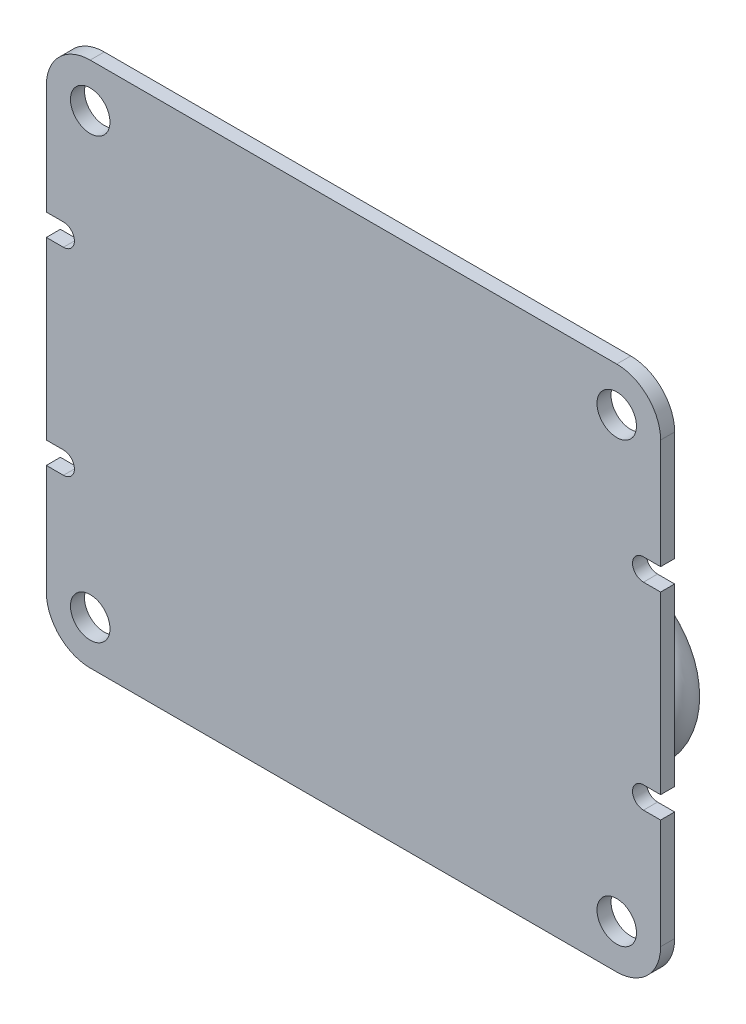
ISO-10303-21;
HEADER;
FILE_DESCRIPTION(('STEP AP214'),'2;1');
FILE_NAME('part.step','',(''),(''),'','','');
FILE_SCHEMA(('AUTOMOTIVE_DESIGN { 1 0 10303 214 1 1 1 1 }'));
ENDSEC;
DATA;
#1=APPLICATION_CONTEXT('core data for automotive mechanical design processes');
#2=APPLICATION_PROTOCOL_DEFINITION('international standard','automotive_design',2000,#1);
#3=PRODUCT_CONTEXT('',#1,'mechanical');
#4=PRODUCT('Part','Part','',(#3));
#5=PRODUCT_RELATED_PRODUCT_CATEGORY('part','',(#4));
#6=PRODUCT_DEFINITION_FORMATION('','',#4);
#7=PRODUCT_DEFINITION_CONTEXT('part definition',#1,'design');
#8=PRODUCT_DEFINITION('design','',#6,#7);
#9=PRODUCT_DEFINITION_SHAPE('','',#8);
#10=(LENGTH_UNIT() NAMED_UNIT(*) SI_UNIT(.MILLI.,.METRE.));
#11=(NAMED_UNIT(*) PLANE_ANGLE_UNIT() SI_UNIT($,.RADIAN.));
#12=(NAMED_UNIT(*) SI_UNIT($,.STERADIAN.) SOLID_ANGLE_UNIT());
#13=UNCERTAINTY_MEASURE_WITH_UNIT(LENGTH_MEASURE(1.E-05),#10,'distance_accuracy_value','');
#14=(GEOMETRIC_REPRESENTATION_CONTEXT(3) GLOBAL_UNCERTAINTY_ASSIGNED_CONTEXT((#13)) GLOBAL_UNIT_ASSIGNED_CONTEXT((#10,
#11,#12)) REPRESENTATION_CONTEXT('',''));
#15=CARTESIAN_POINT('',(0.,0.,0.));
#16=DIRECTION('',(0.,0.,1.));
#17=DIRECTION('',(1.,0.,0.));
#18=AXIS2_PLACEMENT_3D('',#15,#16,#17);
#19=CARTESIAN_POINT('',(30.,25.,0.));
#20=DIRECTION('',(0.,0.,1.));
#21=DIRECTION('',(1.,0.,0.));
#22=AXIS2_PLACEMENT_3D('',#19,#20,#21);
#23=PLANE('',#22);
#24=CARTESIAN_POINT('',(30.,25.,0.));
#25=DIRECTION('',(0.,0.,1.));
#26=DIRECTION('',(1.,0.,0.));
#27=AXIS2_PLACEMENT_3D('',#24,#25,#26);
#28=CIRCLE('',#27,2.24999999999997);
#29=CARTESIAN_POINT('',(32.25,25.,0.));
#30=VERTEX_POINT('',#29);
#31=EDGE_CURVE('E686',#30,#30,#28,.T.);
#32=ORIENTED_EDGE('',*,*,#31,.T.);
#33=EDGE_LOOP('',(#32));
#34=FACE_BOUND('',#33,.T.);
#35=CARTESIAN_POINT('',(-30.,25.,0.));
#36=DIRECTION('',(0.,0.,1.));
#37=DIRECTION('',(1.,0.,0.));
#38=AXIS2_PLACEMENT_3D('',#35,#36,#37);
#39=CIRCLE('',#38,2.24999999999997);
#40=CARTESIAN_POINT('',(-27.75,25.,0.));
#41=VERTEX_POINT('',#40);
#42=EDGE_CURVE('E697',#41,#41,#39,.T.);
#43=ORIENTED_EDGE('',*,*,#42,.T.);
#44=EDGE_LOOP('',(#43));
#45=FACE_BOUND('',#44,.T.);
#46=CARTESIAN_POINT('',(30.,25.,0.));
#47=DIRECTION('',(0.,0.,1.));
#48=DIRECTION('',(1.,0.,0.));
#49=AXIS2_PLACEMENT_3D('',#46,#47,#48);
#50=CIRCLE('',#49,5.);
#51=CARTESIAN_POINT('',(35.,25.,0.));
#52=VERTEX_POINT('',#51);
#53=CARTESIAN_POINT('',(30.,30.,0.));
#54=VERTEX_POINT('',#53);
#55=EDGE_CURVE('E180',#52,#54,#50,.T.);
#56=ORIENTED_EDGE('',*,*,#55,.F.);
#57=DIRECTION('',(0.,1.,0.));
#58=VECTOR('',#57,1.);
#59=CARTESIAN_POINT('',(35.,12.5,0.));
#60=LINE('',#59,#58);
#61=CARTESIAN_POINT('',(35.,12.5,0.));
#62=VERTEX_POINT('',#61);
#63=EDGE_CURVE('E243',#62,#52,#60,.T.);
#64=ORIENTED_EDGE('',*,*,#63,.F.);
#65=DIRECTION('',(1.,0.,0.));
#66=VECTOR('',#65,1.);
#67=CARTESIAN_POINT('',(33.05,12.5,0.));
#68=LINE('',#67,#66);
#69=CARTESIAN_POINT('',(33.05,12.5,0.));
#70=VERTEX_POINT('',#69);
#71=EDGE_CURVE('E241',#70,#62,#68,.T.);
#72=ORIENTED_EDGE('',*,*,#71,.F.);
#73=CARTESIAN_POINT('',(33.05,11.25,0.));
#74=DIRECTION('',(0.,0.,-1.));
#75=DIRECTION('',(1.,0.,0.));
#76=AXIS2_PLACEMENT_3D('',#73,#74,#75);
#77=CIRCLE('',#76,1.25);
#78=CARTESIAN_POINT('',(33.05,10.,0.));
#79=VERTEX_POINT('',#78);
#80=EDGE_CURVE('E239',#79,#70,#77,.T.);
#81=ORIENTED_EDGE('',*,*,#80,.F.);
#82=DIRECTION('',(-1.,0.,0.));
#83=VECTOR('',#82,1.);
#84=CARTESIAN_POINT('',(33.05,10.,0.));
#85=LINE('',#84,#83);
#86=CARTESIAN_POINT('',(35.,10.,0.));
#87=VERTEX_POINT('',#86);
#88=EDGE_CURVE('E237',#87,#79,#85,.T.);
#89=ORIENTED_EDGE('',*,*,#88,.F.);
#90=DIRECTION('',(0.,1.,0.));
#91=VECTOR('',#90,1.);
#92=CARTESIAN_POINT('',(35.,10.,0.));
#93=LINE('',#92,#91);
#94=CARTESIAN_POINT('',(35.,-10.,0.));
#95=VERTEX_POINT('',#94);
#96=EDGE_CURVE('E235',#95,#87,#93,.T.);
#97=ORIENTED_EDGE('',*,*,#96,.F.);
#98=DIRECTION('',(1.,0.,0.));
#99=VECTOR('',#98,1.);
#100=CARTESIAN_POINT('',(33.05,-10.,0.));
#101=LINE('',#100,#99);
#102=CARTESIAN_POINT('',(33.05,-10.,0.));
#103=VERTEX_POINT('',#102);
#104=EDGE_CURVE('E233',#103,#95,#101,.T.);
#105=ORIENTED_EDGE('',*,*,#104,.F.);
#106=CARTESIAN_POINT('',(33.05,-11.25,0.));
#107=DIRECTION('',(0.,0.,-1.));
#108=DIRECTION('',(1.,0.,0.));
#109=AXIS2_PLACEMENT_3D('',#106,#107,#108);
#110=CIRCLE('',#109,1.25);
#111=CARTESIAN_POINT('',(33.05,-12.5,0.));
#112=VERTEX_POINT('',#111);
#113=EDGE_CURVE('E231',#112,#103,#110,.T.);
#114=ORIENTED_EDGE('',*,*,#113,.F.);
#115=DIRECTION('',(-1.,0.,0.));
#116=VECTOR('',#115,1.);
#117=CARTESIAN_POINT('',(33.05,-12.5,0.));
#118=LINE('',#117,#116);
#119=CARTESIAN_POINT('',(35.,-12.5,0.));
#120=VERTEX_POINT('',#119);
#121=EDGE_CURVE('E229',#120,#112,#118,.T.);
#122=ORIENTED_EDGE('',*,*,#121,.F.);
#123=DIRECTION('',(0.,1.,0.));
#124=VECTOR('',#123,1.);
#125=CARTESIAN_POINT('',(35.,-12.5,0.));
#126=LINE('',#125,#124);
#127=CARTESIAN_POINT('',(35.,-25.,0.));
#128=VERTEX_POINT('',#127);
#129=EDGE_CURVE('E227',#128,#120,#126,.T.);
#130=ORIENTED_EDGE('',*,*,#129,.F.);
#131=CARTESIAN_POINT('',(30.,-25.,0.));
#132=DIRECTION('',(0.,0.,1.));
#133=DIRECTION('',(1.,0.,0.));
#134=AXIS2_PLACEMENT_3D('',#131,#132,#133);
#135=CIRCLE('',#134,5.);
#136=CARTESIAN_POINT('',(30.,-30.,0.));
#137=VERTEX_POINT('',#136);
#138=EDGE_CURVE('E225',#137,#128,#135,.T.);
#139=ORIENTED_EDGE('',*,*,#138,.F.);
#140=DIRECTION('',(1.,0.,0.));
#141=VECTOR('',#140,1.);
#142=CARTESIAN_POINT('',(30.,-30.,0.));
#143=LINE('',#142,#141);
#144=CARTESIAN_POINT('',(-30.,-30.,0.));
#145=VERTEX_POINT('',#144);
#146=EDGE_CURVE('E223',#145,#137,#143,.T.);
#147=ORIENTED_EDGE('',*,*,#146,.F.);
#148=CARTESIAN_POINT('',(-30.,-25.,0.));
#149=DIRECTION('',(0.,0.,1.));
#150=DIRECTION('',(1.,0.,0.));
#151=AXIS2_PLACEMENT_3D('',#148,#149,#150);
#152=CIRCLE('',#151,5.);
#153=CARTESIAN_POINT('',(-35.,-25.,0.));
#154=VERTEX_POINT('',#153);
#155=EDGE_CURVE('E221',#154,#145,#152,.T.);
#156=ORIENTED_EDGE('',*,*,#155,.F.);
#157=DIRECTION('',(0.,-1.,0.));
#158=VECTOR('',#157,1.);
#159=CARTESIAN_POINT('',(-35.,-12.5,0.));
#160=LINE('',#159,#158);
#161=CARTESIAN_POINT('',(-35.,-12.5,0.));
#162=VERTEX_POINT('',#161);
#163=EDGE_CURVE('E219',#162,#154,#160,.T.);
#164=ORIENTED_EDGE('',*,*,#163,.F.);
#165=DIRECTION('',(-1.,0.,0.));
#166=VECTOR('',#165,1.);
#167=CARTESIAN_POINT('',(-33.05,-12.5,0.));
#168=LINE('',#167,#166);
#169=CARTESIAN_POINT('',(-33.05,-12.5,0.));
#170=VERTEX_POINT('',#169);
#171=EDGE_CURVE('E217',#170,#162,#168,.T.);
#172=ORIENTED_EDGE('',*,*,#171,.F.);
#173=CARTESIAN_POINT('',(-33.05,-11.25,0.));
#174=DIRECTION('',(0.,0.,-1.));
#175=DIRECTION('',(1.,0.,0.));
#176=AXIS2_PLACEMENT_3D('',#173,#174,#175);
#177=CIRCLE('',#176,1.25);
#178=CARTESIAN_POINT('',(-33.05,-10.,0.));
#179=VERTEX_POINT('',#178);
#180=EDGE_CURVE('E215',#179,#170,#177,.T.);
#181=ORIENTED_EDGE('',*,*,#180,.F.);
#182=DIRECTION('',(1.,0.,0.));
#183=VECTOR('',#182,1.);
#184=CARTESIAN_POINT('',(-33.05,-10.,0.));
#185=LINE('',#184,#183);
#186=CARTESIAN_POINT('',(-35.,-10.,0.));
#187=VERTEX_POINT('',#186);
#188=EDGE_CURVE('E213',#187,#179,#185,.T.);
#189=ORIENTED_EDGE('',*,*,#188,.F.);
#190=DIRECTION('',(0.,-1.,0.));
#191=VECTOR('',#190,1.);
#192=CARTESIAN_POINT('',(-35.,-10.,0.));
#193=LINE('',#192,#191);
#194=CARTESIAN_POINT('',(-35.,10.,0.));
#195=VERTEX_POINT('',#194);
#196=EDGE_CURVE('E211',#195,#187,#193,.T.);
#197=ORIENTED_EDGE('',*,*,#196,.F.);
#198=DIRECTION('',(-1.,0.,0.));
#199=VECTOR('',#198,1.);
#200=CARTESIAN_POINT('',(-33.05,10.,0.));
#201=LINE('',#200,#199);
#202=CARTESIAN_POINT('',(-33.05,10.,0.));
#203=VERTEX_POINT('',#202);
#204=EDGE_CURVE('E209',#203,#195,#201,.T.);
#205=ORIENTED_EDGE('',*,*,#204,.F.);
#206=CARTESIAN_POINT('',(-33.05,11.25,0.));
#207=DIRECTION('',(0.,0.,-1.));
#208=DIRECTION('',(1.,0.,0.));
#209=AXIS2_PLACEMENT_3D('',#206,#207,#208);
#210=CIRCLE('',#209,1.25);
#211=CARTESIAN_POINT('',(-33.05,12.5,0.));
#212=VERTEX_POINT('',#211);
#213=EDGE_CURVE('E207',#212,#203,#210,.T.);
#214=ORIENTED_EDGE('',*,*,#213,.F.);
#215=DIRECTION('',(1.,0.,0.));
#216=VECTOR('',#215,1.);
#217=CARTESIAN_POINT('',(-33.05,12.5,0.));
#218=LINE('',#217,#216);
#219=CARTESIAN_POINT('',(-35.,12.5,0.));
#220=VERTEX_POINT('',#219);
#221=EDGE_CURVE('E205',#220,#212,#218,.T.);
#222=ORIENTED_EDGE('',*,*,#221,.F.);
#223=DIRECTION('',(0.,-1.,0.));
#224=VECTOR('',#223,1.);
#225=CARTESIAN_POINT('',(-35.,12.5,0.));
#226=LINE('',#225,#224);
#227=CARTESIAN_POINT('',(-35.,25.,0.));
#228=VERTEX_POINT('',#227);
#229=EDGE_CURVE('E203',#228,#220,#226,.T.);
#230=ORIENTED_EDGE('',*,*,#229,.F.);
#231=CARTESIAN_POINT('',(-30.,25.,0.));
#232=DIRECTION('',(0.,0.,1.));
#233=DIRECTION('',(1.,0.,0.));
#234=AXIS2_PLACEMENT_3D('',#231,#232,#233);
#235=CIRCLE('',#234,5.);
#236=CARTESIAN_POINT('',(-30.,30.,0.));
#237=VERTEX_POINT('',#236);
#238=EDGE_CURVE('E182',#237,#228,#235,.T.);
#239=ORIENTED_EDGE('',*,*,#238,.F.);
#240=DIRECTION('',(-1.,0.,0.));
#241=VECTOR('',#240,1.);
#242=CARTESIAN_POINT('',(30.,30.,0.));
#243=LINE('',#242,#241);
#244=EDGE_CURVE('E175',#54,#237,#243,.T.);
#245=ORIENTED_EDGE('',*,*,#244,.F.);
#246=EDGE_LOOP('',(#56,#64,#72,#81,#89,#97,#105,#114,#122,#130,#139,#147,#156,#164,#172,#181,
#189,#197,#205,#214,#222,#230,#239,#245));
#247=FACE_BOUND('',#246,.T.);
#248=CARTESIAN_POINT('',(-30.,-25.,0.));
#249=DIRECTION('',(0.,0.,1.));
#250=DIRECTION('',(1.,0.,0.));
#251=AXIS2_PLACEMENT_3D('',#248,#249,#250);
#252=CIRCLE('',#251,2.24999999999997);
#253=CARTESIAN_POINT('',(-27.75,-25.,0.));
#254=VERTEX_POINT('',#253);
#255=EDGE_CURVE('E198',#254,#254,#252,.T.);
#256=ORIENTED_EDGE('',*,*,#255,.T.);
#257=EDGE_LOOP('',(#256));
#258=FACE_BOUND('',#257,.T.);
#259=CARTESIAN_POINT('',(30.,-25.,0.));
#260=DIRECTION('',(0.,0.,1.));
#261=DIRECTION('',(1.,0.,0.));
#262=AXIS2_PLACEMENT_3D('',#259,#260,#261);
#263=CIRCLE('',#262,2.24999999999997);
#264=CARTESIAN_POINT('',(32.25,-25.,0.));
#265=VERTEX_POINT('',#264);
#266=EDGE_CURVE('E691',#265,#265,#263,.T.);
#267=ORIENTED_EDGE('',*,*,#266,.T.);
#268=EDGE_LOOP('',(#267));
#269=FACE_BOUND('',#268,.T.);
#270=CARTESIAN_POINT('',(0.,6.7,0.));
#271=DIRECTION('',(0.,0.,1.));
#272=DIRECTION('',(1.,0.,0.));
#273=AXIS2_PLACEMENT_3D('',#270,#271,#272);
#274=CIRCLE('',#273,6.562742);
#275=CARTESIAN_POINT('',(6.562742,6.7,0.));
#276=VERTEX_POINT('',#275);
#277=EDGE_CURVE('E683',#276,#276,#274,.T.);
#278=ORIENTED_EDGE('',*,*,#277,.T.);
#279=EDGE_LOOP('',(#278));
#280=FACE_BOUND('',#279,.T.);
#281=CARTESIAN_POINT('',(22.,-6.7,0.));
#282=DIRECTION('',(0.,0.,1.));
#283=DIRECTION('',(1.,0.,0.));
#284=AXIS2_PLACEMENT_3D('',#281,#282,#283);
#285=CIRCLE('',#284,6.562742);
#286=CARTESIAN_POINT('',(28.562742,-6.7,0.));
#287=VERTEX_POINT('',#286);
#288=EDGE_CURVE('E656',#287,#287,#285,.T.);
#289=ORIENTED_EDGE('',*,*,#288,.T.);
#290=EDGE_LOOP('',(#289));
#291=FACE_BOUND('',#290,.T.);
#292=CARTESIAN_POINT('',(-22.,-6.7,0.));
#293=DIRECTION('',(0.,0.,1.));
#294=DIRECTION('',(1.,0.,0.));
#295=AXIS2_PLACEMENT_3D('',#292,#293,#294);
#296=CIRCLE('',#295,6.562742);
#297=CARTESIAN_POINT('',(-15.437258,-6.7,0.));
#298=VERTEX_POINT('',#297);
#299=EDGE_CURVE('E9',#298,#298,#296,.F.);
#300=ORIENTED_EDGE('',*,*,#299,.F.);
#301=EDGE_LOOP('',(#300));
#302=FACE_BOUND('',#301,.T.);
#303=ADVANCED_FACE('F14',(#34,#45,#247,#258,#269,#280,#291,#302),#23,.F.);
#304=CARTESIAN_POINT('',(30.,25.,1.6));
#305=DIRECTION('',(0.,0.,1.));
#306=DIRECTION('',(1.,0.,0.));
#307=AXIS2_PLACEMENT_3D('',#304,#305,#306);
#308=PLANE('',#307);
#309=CARTESIAN_POINT('',(30.,-25.,1.6));
#310=DIRECTION('',(0.,0.,1.));
#311=DIRECTION('',(1.,0.,0.));
#312=AXIS2_PLACEMENT_3D('',#309,#310,#311);
#313=CIRCLE('',#312,2.24999999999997);
#314=CARTESIAN_POINT('',(32.25,-25.,1.6));
#315=VERTEX_POINT('',#314);
#316=EDGE_CURVE('E694',#315,#315,#313,.T.);
#317=ORIENTED_EDGE('',*,*,#316,.F.);
#318=EDGE_LOOP('',(#317));
#319=FACE_BOUND('',#318,.T.);
#320=CARTESIAN_POINT('',(-30.,-25.,1.6));
#321=DIRECTION('',(0.,0.,1.));
#322=DIRECTION('',(1.,0.,0.));
#323=AXIS2_PLACEMENT_3D('',#320,#321,#322);
#324=CIRCLE('',#323,2.24999999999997);
#325=CARTESIAN_POINT('',(-27.75,-25.,1.6));
#326=VERTEX_POINT('',#325);
#327=EDGE_CURVE('E195',#326,#326,#324,.T.);
#328=ORIENTED_EDGE('',*,*,#327,.F.);
#329=EDGE_LOOP('',(#328));
#330=FACE_BOUND('',#329,.T.);
#331=CARTESIAN_POINT('',(30.,25.,1.6));
#332=DIRECTION('',(0.,0.,1.));
#333=DIRECTION('',(1.,0.,0.));
#334=AXIS2_PLACEMENT_3D('',#331,#332,#333);
#335=CIRCLE('',#334,5.);
#336=CARTESIAN_POINT('',(35.,25.,1.6));
#337=VERTEX_POINT('',#336);
#338=CARTESIAN_POINT('',(30.,30.,1.6));
#339=VERTEX_POINT('',#338);
#340=EDGE_CURVE('E245',#337,#339,#335,.T.);
#341=ORIENTED_EDGE('',*,*,#340,.T.);
#342=DIRECTION('',(-1.,0.,0.));
#343=VECTOR('',#342,1.);
#344=CARTESIAN_POINT('',(30.,30.,1.6));
#345=LINE('',#344,#343);
#346=CARTESIAN_POINT('',(-30.,30.,1.6));
#347=VERTEX_POINT('',#346);
#348=EDGE_CURVE('E189',#339,#347,#345,.T.);
#349=ORIENTED_EDGE('',*,*,#348,.T.);
#350=CARTESIAN_POINT('',(-30.,25.,1.6));
#351=DIRECTION('',(0.,0.,1.));
#352=DIRECTION('',(1.,0.,0.));
#353=AXIS2_PLACEMENT_3D('',#350,#351,#352);
#354=CIRCLE('',#353,5.);
#355=CARTESIAN_POINT('',(-35.,25.,1.6));
#356=VERTEX_POINT('',#355);
#357=EDGE_CURVE('E248',#347,#356,#354,.T.);
#358=ORIENTED_EDGE('',*,*,#357,.T.);
#359=DIRECTION('',(0.,-1.,0.));
#360=VECTOR('',#359,1.);
#361=CARTESIAN_POINT('',(-35.,12.5,1.6));
#362=LINE('',#361,#360);
#363=CARTESIAN_POINT('',(-35.,12.5,1.6));
#364=VERTEX_POINT('',#363);
#365=EDGE_CURVE('E250',#356,#364,#362,.T.);
#366=ORIENTED_EDGE('',*,*,#365,.T.);
#367=DIRECTION('',(1.,0.,0.));
#368=VECTOR('',#367,1.);
#369=CARTESIAN_POINT('',(-33.05,12.5,1.6));
#370=LINE('',#369,#368);
#371=CARTESIAN_POINT('',(-33.05,12.5,1.6));
#372=VERTEX_POINT('',#371);
#373=EDGE_CURVE('E252',#364,#372,#370,.T.);
#374=ORIENTED_EDGE('',*,*,#373,.T.);
#375=CARTESIAN_POINT('',(-33.05,11.25,1.6));
#376=DIRECTION('',(0.,0.,-1.));
#377=DIRECTION('',(1.,0.,0.));
#378=AXIS2_PLACEMENT_3D('',#375,#376,#377);
#379=CIRCLE('',#378,1.25);
#380=CARTESIAN_POINT('',(-33.05,10.,1.6));
#381=VERTEX_POINT('',#380);
#382=EDGE_CURVE('E254',#372,#381,#379,.T.);
#383=ORIENTED_EDGE('',*,*,#382,.T.);
#384=DIRECTION('',(-1.,0.,0.));
#385=VECTOR('',#384,1.);
#386=CARTESIAN_POINT('',(-33.05,10.,1.6));
#387=LINE('',#386,#385);
#388=CARTESIAN_POINT('',(-35.,10.,1.6));
#389=VERTEX_POINT('',#388);
#390=EDGE_CURVE('E256',#381,#389,#387,.T.);
#391=ORIENTED_EDGE('',*,*,#390,.T.);
#392=DIRECTION('',(0.,-1.,0.));
#393=VECTOR('',#392,1.);
#394=CARTESIAN_POINT('',(-35.,-10.,1.6));
#395=LINE('',#394,#393);
#396=CARTESIAN_POINT('',(-35.,-10.,1.6));
#397=VERTEX_POINT('',#396);
#398=EDGE_CURVE('E258',#389,#397,#395,.T.);
#399=ORIENTED_EDGE('',*,*,#398,.T.);
#400=DIRECTION('',(1.,0.,0.));
#401=VECTOR('',#400,1.);
#402=CARTESIAN_POINT('',(-33.05,-10.,1.6));
#403=LINE('',#402,#401);
#404=CARTESIAN_POINT('',(-33.05,-10.,1.6));
#405=VERTEX_POINT('',#404);
#406=EDGE_CURVE('E260',#397,#405,#403,.T.);
#407=ORIENTED_EDGE('',*,*,#406,.T.);
#408=CARTESIAN_POINT('',(-33.05,-11.25,1.6));
#409=DIRECTION('',(0.,0.,-1.));
#410=DIRECTION('',(1.,0.,0.));
#411=AXIS2_PLACEMENT_3D('',#408,#409,#410);
#412=CIRCLE('',#411,1.25);
#413=CARTESIAN_POINT('',(-33.05,-12.5,1.6));
#414=VERTEX_POINT('',#413);
#415=EDGE_CURVE('E262',#405,#414,#412,.T.);
#416=ORIENTED_EDGE('',*,*,#415,.T.);
#417=DIRECTION('',(-1.,0.,0.));
#418=VECTOR('',#417,1.);
#419=CARTESIAN_POINT('',(-33.05,-12.5,1.6));
#420=LINE('',#419,#418);
#421=CARTESIAN_POINT('',(-35.,-12.5,1.6));
#422=VERTEX_POINT('',#421);
#423=EDGE_CURVE('E264',#414,#422,#420,.T.);
#424=ORIENTED_EDGE('',*,*,#423,.T.);
#425=DIRECTION('',(0.,-1.,0.));
#426=VECTOR('',#425,1.);
#427=CARTESIAN_POINT('',(-35.,-12.5,1.6));
#428=LINE('',#427,#426);
#429=CARTESIAN_POINT('',(-35.,-25.,1.6));
#430=VERTEX_POINT('',#429);
#431=EDGE_CURVE('E266',#422,#430,#428,.T.);
#432=ORIENTED_EDGE('',*,*,#431,.T.);
#433=CARTESIAN_POINT('',(-30.,-25.,1.6));
#434=DIRECTION('',(0.,0.,1.));
#435=DIRECTION('',(1.,0.,0.));
#436=AXIS2_PLACEMENT_3D('',#433,#434,#435);
#437=CIRCLE('',#436,5.);
#438=CARTESIAN_POINT('',(-30.,-30.,1.6));
#439=VERTEX_POINT('',#438);
#440=EDGE_CURVE('E268',#430,#439,#437,.T.);
#441=ORIENTED_EDGE('',*,*,#440,.T.);
#442=DIRECTION('',(1.,0.,0.));
#443=VECTOR('',#442,1.);
#444=CARTESIAN_POINT('',(30.,-30.,1.6));
#445=LINE('',#444,#443);
#446=CARTESIAN_POINT('',(30.,-30.,1.6));
#447=VERTEX_POINT('',#446);
#448=EDGE_CURVE('E270',#439,#447,#445,.T.);
#449=ORIENTED_EDGE('',*,*,#448,.T.);
#450=CARTESIAN_POINT('',(30.,-25.,1.6));
#451=DIRECTION('',(0.,0.,1.));
#452=DIRECTION('',(1.,0.,0.));
#453=AXIS2_PLACEMENT_3D('',#450,#451,#452);
#454=CIRCLE('',#453,5.);
#455=CARTESIAN_POINT('',(35.,-25.,1.6));
#456=VERTEX_POINT('',#455);
#457=EDGE_CURVE('E272',#447,#456,#454,.T.);
#458=ORIENTED_EDGE('',*,*,#457,.T.);
#459=DIRECTION('',(0.,1.,0.));
#460=VECTOR('',#459,1.);
#461=CARTESIAN_POINT('',(35.,-12.5,1.6));
#462=LINE('',#461,#460);
#463=CARTESIAN_POINT('',(35.,-12.5,1.6));
#464=VERTEX_POINT('',#463);
#465=EDGE_CURVE('E274',#456,#464,#462,.T.);
#466=ORIENTED_EDGE('',*,*,#465,.T.);
#467=DIRECTION('',(-1.,0.,0.));
#468=VECTOR('',#467,1.);
#469=CARTESIAN_POINT('',(33.05,-12.5,1.6));
#470=LINE('',#469,#468);
#471=CARTESIAN_POINT('',(33.05,-12.5,1.6));
#472=VERTEX_POINT('',#471);
#473=EDGE_CURVE('E276',#464,#472,#470,.T.);
#474=ORIENTED_EDGE('',*,*,#473,.T.);
#475=CARTESIAN_POINT('',(33.05,-11.25,1.6));
#476=DIRECTION('',(0.,0.,-1.));
#477=DIRECTION('',(1.,0.,0.));
#478=AXIS2_PLACEMENT_3D('',#475,#476,#477);
#479=CIRCLE('',#478,1.25);
#480=CARTESIAN_POINT('',(33.05,-10.,1.6));
#481=VERTEX_POINT('',#480);
#482=EDGE_CURVE('E278',#472,#481,#479,.T.);
#483=ORIENTED_EDGE('',*,*,#482,.T.);
#484=DIRECTION('',(1.,0.,0.));
#485=VECTOR('',#484,1.);
#486=CARTESIAN_POINT('',(33.05,-10.,1.6));
#487=LINE('',#486,#485);
#488=CARTESIAN_POINT('',(35.,-10.,1.6));
#489=VERTEX_POINT('',#488);
#490=EDGE_CURVE('E280',#481,#489,#487,.T.);
#491=ORIENTED_EDGE('',*,*,#490,.T.);
#492=DIRECTION('',(0.,1.,0.));
#493=VECTOR('',#492,1.);
#494=CARTESIAN_POINT('',(35.,10.,1.6));
#495=LINE('',#494,#493);
#496=CARTESIAN_POINT('',(35.,10.,1.6));
#497=VERTEX_POINT('',#496);
#498=EDGE_CURVE('E282',#489,#497,#495,.T.);
#499=ORIENTED_EDGE('',*,*,#498,.T.);
#500=DIRECTION('',(-1.,0.,0.));
#501=VECTOR('',#500,1.);
#502=CARTESIAN_POINT('',(33.05,10.,1.6));
#503=LINE('',#502,#501);
#504=CARTESIAN_POINT('',(33.05,10.,1.6));
#505=VERTEX_POINT('',#504);
#506=EDGE_CURVE('E284',#497,#505,#503,.T.);
#507=ORIENTED_EDGE('',*,*,#506,.T.);
#508=CARTESIAN_POINT('',(33.05,11.25,1.6));
#509=DIRECTION('',(0.,0.,-1.));
#510=DIRECTION('',(1.,0.,0.));
#511=AXIS2_PLACEMENT_3D('',#508,#509,#510);
#512=CIRCLE('',#511,1.25);
#513=CARTESIAN_POINT('',(33.05,12.5,1.6));
#514=VERTEX_POINT('',#513);
#515=EDGE_CURVE('E286',#505,#514,#512,.T.);
#516=ORIENTED_EDGE('',*,*,#515,.T.);
#517=DIRECTION('',(1.,0.,0.));
#518=VECTOR('',#517,1.);
#519=CARTESIAN_POINT('',(33.05,12.5,1.6));
#520=LINE('',#519,#518);
#521=CARTESIAN_POINT('',(35.,12.5,1.6));
#522=VERTEX_POINT('',#521);
#523=EDGE_CURVE('E34',#514,#522,#520,.T.);
#524=ORIENTED_EDGE('',*,*,#523,.T.);
#525=DIRECTION('',(0.,1.,0.));
#526=VECTOR('',#525,1.);
#527=CARTESIAN_POINT('',(35.,12.5,1.6));
#528=LINE('',#527,#526);
#529=EDGE_CURVE('E29',#522,#337,#528,.T.);
#530=ORIENTED_EDGE('',*,*,#529,.T.);
#531=EDGE_LOOP('',(#341,#349,#358,#366,#374,#383,#391,#399,#407,#416,#424,#432,#441,#449,#458,
#466,#474,#483,#491,#499,#507,#516,#524,#530));
#532=FACE_BOUND('',#531,.T.);
#533=CARTESIAN_POINT('',(-30.,25.,1.6));
#534=DIRECTION('',(0.,0.,1.));
#535=DIRECTION('',(1.,0.,0.));
#536=AXIS2_PLACEMENT_3D('',#533,#534,#535);
#537=CIRCLE('',#536,2.24999999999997);
#538=CARTESIAN_POINT('',(-27.75,25.,1.6));
#539=VERTEX_POINT('',#538);
#540=EDGE_CURVE('E700',#539,#539,#537,.T.);
#541=ORIENTED_EDGE('',*,*,#540,.F.);
#542=EDGE_LOOP('',(#541));
#543=FACE_BOUND('',#542,.T.);
#544=CARTESIAN_POINT('',(30.,25.,1.6));
#545=DIRECTION('',(0.,0.,1.));
#546=DIRECTION('',(1.,0.,0.));
#547=AXIS2_PLACEMENT_3D('',#544,#545,#546);
#548=CIRCLE('',#547,2.24999999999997);
#549=CARTESIAN_POINT('',(32.25,25.,1.6));
#550=VERTEX_POINT('',#549);
#551=EDGE_CURVE('E688',#550,#550,#548,.T.);
#552=ORIENTED_EDGE('',*,*,#551,.F.);
#553=EDGE_LOOP('',(#552));
#554=FACE_BOUND('',#553,.T.);
#555=ADVANCED_FACE('F359',(#319,#330,#532,#543,#554),#308,.T.);
#556=CARTESIAN_POINT('',(30.,25.,1.6));
#557=DIRECTION('',(0.,0.,-1.));
#558=DIRECTION('',(-1.,0.,0.));
#559=AXIS2_PLACEMENT_3D('',#556,#557,#558);
#560=CYLINDRICAL_SURFACE('',#559,5.);
#561=ORIENTED_EDGE('',*,*,#55,.T.);
#562=DIRECTION('',(0.,0.,-1.));
#563=VECTOR('',#562,1.);
#564=CARTESIAN_POINT('',(30.,30.,1.6));
#565=LINE('',#564,#563);
#566=EDGE_CURVE('E22',#339,#54,#565,.T.);
#567=ORIENTED_EDGE('',*,*,#566,.F.);
#568=ORIENTED_EDGE('',*,*,#340,.F.);
#569=DIRECTION('',(0.,0.,-1.));
#570=VECTOR('',#569,1.);
#571=CARTESIAN_POINT('',(35.,25.,1.6));
#572=LINE('',#571,#570);
#573=EDGE_CURVE('E194',#337,#52,#572,.T.);
#574=ORIENTED_EDGE('',*,*,#573,.T.);
#575=EDGE_LOOP('',(#561,#567,#568,#574));
#576=FACE_BOUND('',#575,.T.);
#577=ADVANCED_FACE('F16',(#576),#560,.T.);
#578=CARTESIAN_POINT('',(30.,30.,1.6));
#579=DIRECTION('',(0.,-1.,0.));
#580=DIRECTION('',(0.,0.,-1.));
#581=AXIS2_PLACEMENT_3D('',#578,#579,#580);
#582=PLANE('',#581);
#583=ORIENTED_EDGE('',*,*,#244,.T.);
#584=DIRECTION('',(0.,0.,-1.));
#585=VECTOR('',#584,1.);
#586=CARTESIAN_POINT('',(-30.,30.,1.6));
#587=LINE('',#586,#585);
#588=EDGE_CURVE('E192',#347,#237,#587,.T.);
#589=ORIENTED_EDGE('',*,*,#588,.F.);
#590=ORIENTED_EDGE('',*,*,#348,.F.);
#591=ORIENTED_EDGE('',*,*,#566,.T.);
#592=EDGE_LOOP('',(#583,#589,#590,#591));
#593=FACE_BOUND('',#592,.T.);
#594=ADVANCED_FACE('F188',(#593),#582,.F.);
#595=CARTESIAN_POINT('',(-30.,25.,1.6));
#596=DIRECTION('',(0.,0.,-1.));
#597=DIRECTION('',(-1.,0.,0.));
#598=AXIS2_PLACEMENT_3D('',#595,#596,#597);
#599=CYLINDRICAL_SURFACE('',#598,5.);
#600=ORIENTED_EDGE('',*,*,#238,.T.);
#601=DIRECTION('',(0.,0.,-1.));
#602=VECTOR('',#601,1.);
#603=CARTESIAN_POINT('',(-35.,25.,1.6));
#604=LINE('',#603,#602);
#605=EDGE_CURVE('E351',#356,#228,#604,.T.);
#606=ORIENTED_EDGE('',*,*,#605,.F.);
#607=ORIENTED_EDGE('',*,*,#357,.F.);
#608=ORIENTED_EDGE('',*,*,#588,.T.);
#609=EDGE_LOOP('',(#600,#606,#607,#608));
#610=FACE_BOUND('',#609,.T.);
#611=ADVANCED_FACE('F356',(#610),#599,.T.);
#612=CARTESIAN_POINT('',(-35.,12.5,1.6));
#613=DIRECTION('',(1.,0.,0.));
#614=DIRECTION('',(0.,0.,-1.));
#615=AXIS2_PLACEMENT_3D('',#612,#613,#614);
#616=PLANE('',#615);
#617=ORIENTED_EDGE('',*,*,#229,.T.);
#618=DIRECTION('',(0.,0.,-1.));
#619=VECTOR('',#618,1.);
#620=CARTESIAN_POINT('',(-35.,12.5,1.6));
#621=LINE('',#620,#619);
#622=EDGE_CURVE('E348',#364,#220,#621,.T.);
#623=ORIENTED_EDGE('',*,*,#622,.F.);
#624=ORIENTED_EDGE('',*,*,#365,.F.);
#625=ORIENTED_EDGE('',*,*,#605,.T.);
#626=EDGE_LOOP('',(#617,#623,#624,#625));
#627=FACE_BOUND('',#626,.T.);
#628=ADVANCED_FACE('F365',(#627),#616,.F.);
#629=CARTESIAN_POINT('',(-33.05,12.5,1.6));
#630=DIRECTION('',(0.,1.,0.));
#631=DIRECTION('',(0.,0.,1.));
#632=AXIS2_PLACEMENT_3D('',#629,#630,#631);
#633=PLANE('',#632);
#634=ORIENTED_EDGE('',*,*,#221,.T.);
#635=DIRECTION('',(0.,0.,-1.));
#636=VECTOR('',#635,1.);
#637=CARTESIAN_POINT('',(-33.05,12.5,1.6));
#638=LINE('',#637,#636);
#639=EDGE_CURVE('E345',#372,#212,#638,.T.);
#640=ORIENTED_EDGE('',*,*,#639,.F.);
#641=ORIENTED_EDGE('',*,*,#373,.F.);
#642=ORIENTED_EDGE('',*,*,#622,.T.);
#643=EDGE_LOOP('',(#634,#640,#641,#642));
#644=FACE_BOUND('',#643,.T.);
#645=ADVANCED_FACE('F368',(#644),#633,.F.);
#646=CARTESIAN_POINT('',(-33.05,11.25,1.6));
#647=DIRECTION('',(0.,0.,-1.));
#648=DIRECTION('',(-1.,0.,0.));
#649=AXIS2_PLACEMENT_3D('',#646,#647,#648);
#650=CYLINDRICAL_SURFACE('',#649,1.25);
#651=ORIENTED_EDGE('',*,*,#213,.T.);
#652=DIRECTION('',(0.,0.,-1.));
#653=VECTOR('',#652,1.);
#654=CARTESIAN_POINT('',(-33.05,10.,1.6));
#655=LINE('',#654,#653);
#656=EDGE_CURVE('E342',#381,#203,#655,.T.);
#657=ORIENTED_EDGE('',*,*,#656,.F.);
#658=ORIENTED_EDGE('',*,*,#382,.F.);
#659=ORIENTED_EDGE('',*,*,#639,.T.);
#660=EDGE_LOOP('',(#651,#657,#658,#659));
#661=FACE_BOUND('',#660,.T.);
#662=ADVANCED_FACE('F373',(#661),#650,.F.);
#663=CARTESIAN_POINT('',(-33.05,10.,1.6));
#664=DIRECTION('',(0.,-1.,0.));
#665=DIRECTION('',(0.,0.,-1.));
#666=AXIS2_PLACEMENT_3D('',#663,#664,#665);
#667=PLANE('',#666);
#668=ORIENTED_EDGE('',*,*,#204,.T.);
#669=DIRECTION('',(0.,0.,-1.));
#670=VECTOR('',#669,1.);
#671=CARTESIAN_POINT('',(-35.,10.,1.6));
#672=LINE('',#671,#670);
#673=EDGE_CURVE('E339',#389,#195,#672,.T.);
#674=ORIENTED_EDGE('',*,*,#673,.F.);
#675=ORIENTED_EDGE('',*,*,#390,.F.);
#676=ORIENTED_EDGE('',*,*,#656,.T.);
#677=EDGE_LOOP('',(#668,#674,#675,#676));
#678=FACE_BOUND('',#677,.T.);
#679=ADVANCED_FACE('F379',(#678),#667,.F.);
#680=CARTESIAN_POINT('',(-35.,-10.,1.6));
#681=DIRECTION('',(1.,0.,0.));
#682=DIRECTION('',(0.,0.,-1.));
#683=AXIS2_PLACEMENT_3D('',#680,#681,#682);
#684=PLANE('',#683);
#685=ORIENTED_EDGE('',*,*,#196,.T.);
#686=DIRECTION('',(0.,0.,-1.));
#687=VECTOR('',#686,1.);
#688=CARTESIAN_POINT('',(-35.,-10.,1.6));
#689=LINE('',#688,#687);
#690=EDGE_CURVE('E336',#397,#187,#689,.T.);
#691=ORIENTED_EDGE('',*,*,#690,.F.);
#692=ORIENTED_EDGE('',*,*,#398,.F.);
#693=ORIENTED_EDGE('',*,*,#673,.T.);
#694=EDGE_LOOP('',(#685,#691,#692,#693));
#695=FACE_BOUND('',#694,.T.);
#696=ADVANCED_FACE('F383',(#695),#684,.F.);
#697=CARTESIAN_POINT('',(-33.05,-10.,1.6));
#698=DIRECTION('',(0.,1.,0.));
#699=DIRECTION('',(0.,0.,1.));
#700=AXIS2_PLACEMENT_3D('',#697,#698,#699);
#701=PLANE('',#700);
#702=ORIENTED_EDGE('',*,*,#188,.T.);
#703=DIRECTION('',(0.,0.,-1.));
#704=VECTOR('',#703,1.);
#705=CARTESIAN_POINT('',(-33.05,-10.,1.6));
#706=LINE('',#705,#704);
#707=EDGE_CURVE('E333',#405,#179,#706,.T.);
#708=ORIENTED_EDGE('',*,*,#707,.F.);
#709=ORIENTED_EDGE('',*,*,#406,.F.);
#710=ORIENTED_EDGE('',*,*,#690,.T.);
#711=EDGE_LOOP('',(#702,#708,#709,#710));
#712=FACE_BOUND('',#711,.T.);
#713=ADVANCED_FACE('F388',(#712),#701,.F.);
#714=CARTESIAN_POINT('',(-33.05,-11.25,1.6));
#715=DIRECTION('',(0.,0.,-1.));
#716=DIRECTION('',(-1.,0.,0.));
#717=AXIS2_PLACEMENT_3D('',#714,#715,#716);
#718=CYLINDRICAL_SURFACE('',#717,1.25);
#719=ORIENTED_EDGE('',*,*,#180,.T.);
#720=DIRECTION('',(0.,0.,-1.));
#721=VECTOR('',#720,1.);
#722=CARTESIAN_POINT('',(-33.05,-12.5,1.6));
#723=LINE('',#722,#721);
#724=EDGE_CURVE('E330',#414,#170,#723,.T.);
#725=ORIENTED_EDGE('',*,*,#724,.F.);
#726=ORIENTED_EDGE('',*,*,#415,.F.);
#727=ORIENTED_EDGE('',*,*,#707,.T.);
#728=EDGE_LOOP('',(#719,#725,#726,#727));
#729=FACE_BOUND('',#728,.T.);
#730=ADVANCED_FACE('F394',(#729),#718,.F.);
#731=CARTESIAN_POINT('',(-33.05,-12.5,1.6));
#732=DIRECTION('',(0.,-1.,0.));
#733=DIRECTION('',(0.,0.,-1.));
#734=AXIS2_PLACEMENT_3D('',#731,#732,#733);
#735=PLANE('',#734);
#736=ORIENTED_EDGE('',*,*,#171,.T.);
#737=DIRECTION('',(0.,0.,-1.));
#738=VECTOR('',#737,1.);
#739=CARTESIAN_POINT('',(-35.,-12.5,1.6));
#740=LINE('',#739,#738);
#741=EDGE_CURVE('E327',#422,#162,#740,.T.);
#742=ORIENTED_EDGE('',*,*,#741,.F.);
#743=ORIENTED_EDGE('',*,*,#423,.F.);
#744=ORIENTED_EDGE('',*,*,#724,.T.);
#745=EDGE_LOOP('',(#736,#742,#743,#744));
#746=FACE_BOUND('',#745,.T.);
#747=ADVANCED_FACE('F398',(#746),#735,.F.);
#748=CARTESIAN_POINT('',(-35.,-12.5,1.6));
#749=DIRECTION('',(1.,0.,0.));
#750=DIRECTION('',(0.,0.,-1.));
#751=AXIS2_PLACEMENT_3D('',#748,#749,#750);
#752=PLANE('',#751);
#753=ORIENTED_EDGE('',*,*,#163,.T.);
#754=DIRECTION('',(0.,0.,-1.));
#755=VECTOR('',#754,1.);
#756=CARTESIAN_POINT('',(-35.,-25.,1.6));
#757=LINE('',#756,#755);
#758=EDGE_CURVE('E324',#430,#154,#757,.T.);
#759=ORIENTED_EDGE('',*,*,#758,.F.);
#760=ORIENTED_EDGE('',*,*,#431,.F.);
#761=ORIENTED_EDGE('',*,*,#741,.T.);
#762=EDGE_LOOP('',(#753,#759,#760,#761));
#763=FACE_BOUND('',#762,.T.);
#764=ADVANCED_FACE('F403',(#763),#752,.F.);
#765=CARTESIAN_POINT('',(-30.,-25.,1.6));
#766=DIRECTION('',(0.,0.,-1.));
#767=DIRECTION('',(-1.,0.,0.));
#768=AXIS2_PLACEMENT_3D('',#765,#766,#767);
#769=CYLINDRICAL_SURFACE('',#768,5.);
#770=ORIENTED_EDGE('',*,*,#155,.T.);
#771=DIRECTION('',(0.,0.,-1.));
#772=VECTOR('',#771,1.);
#773=CARTESIAN_POINT('',(-30.,-30.,1.6));
#774=LINE('',#773,#772);
#775=EDGE_CURVE('E321',#439,#145,#774,.T.);
#776=ORIENTED_EDGE('',*,*,#775,.F.);
#777=ORIENTED_EDGE('',*,*,#440,.F.);
#778=ORIENTED_EDGE('',*,*,#758,.T.);
#779=EDGE_LOOP('',(#770,#776,#777,#778));
#780=FACE_BOUND('',#779,.T.);
#781=ADVANCED_FACE('F409',(#780),#769,.T.);
#782=CARTESIAN_POINT('',(30.,-30.,1.6));
#783=DIRECTION('',(0.,1.,0.));
#784=DIRECTION('',(0.,0.,1.));
#785=AXIS2_PLACEMENT_3D('',#782,#783,#784);
#786=PLANE('',#785);
#787=ORIENTED_EDGE('',*,*,#146,.T.);
#788=DIRECTION('',(0.,0.,-1.));
#789=VECTOR('',#788,1.);
#790=CARTESIAN_POINT('',(30.,-30.,1.6));
#791=LINE('',#790,#789);
#792=EDGE_CURVE('E318',#447,#137,#791,.T.);
#793=ORIENTED_EDGE('',*,*,#792,.F.);
#794=ORIENTED_EDGE('',*,*,#448,.F.);
#795=ORIENTED_EDGE('',*,*,#775,.T.);
#796=EDGE_LOOP('',(#787,#793,#794,#795));
#797=FACE_BOUND('',#796,.T.);
#798=ADVANCED_FACE('F413',(#797),#786,.F.);
#799=CARTESIAN_POINT('',(30.,-25.,1.6));
#800=DIRECTION('',(0.,0.,-1.));
#801=DIRECTION('',(-1.,0.,0.));
#802=AXIS2_PLACEMENT_3D('',#799,#800,#801);
#803=CYLINDRICAL_SURFACE('',#802,5.);
#804=ORIENTED_EDGE('',*,*,#138,.T.);
#805=DIRECTION('',(0.,0.,-1.));
#806=VECTOR('',#805,1.);
#807=CARTESIAN_POINT('',(35.,-25.,1.6));
#808=LINE('',#807,#806);
#809=EDGE_CURVE('E315',#456,#128,#808,.T.);
#810=ORIENTED_EDGE('',*,*,#809,.F.);
#811=ORIENTED_EDGE('',*,*,#457,.F.);
#812=ORIENTED_EDGE('',*,*,#792,.T.);
#813=EDGE_LOOP('',(#804,#810,#811,#812));
#814=FACE_BOUND('',#813,.T.);
#815=ADVANCED_FACE('F418',(#814),#803,.T.);
#816=CARTESIAN_POINT('',(35.,-12.5,1.6));
#817=DIRECTION('',(-1.,0.,0.));
#818=DIRECTION('',(0.,0.,1.));
#819=AXIS2_PLACEMENT_3D('',#816,#817,#818);
#820=PLANE('',#819);
#821=ORIENTED_EDGE('',*,*,#129,.T.);
#822=DIRECTION('',(0.,0.,-1.));
#823=VECTOR('',#822,1.);
#824=CARTESIAN_POINT('',(35.,-12.5,1.6));
#825=LINE('',#824,#823);
#826=EDGE_CURVE('E312',#464,#120,#825,.T.);
#827=ORIENTED_EDGE('',*,*,#826,.F.);
#828=ORIENTED_EDGE('',*,*,#465,.F.);
#829=ORIENTED_EDGE('',*,*,#809,.T.);
#830=EDGE_LOOP('',(#821,#827,#828,#829));
#831=FACE_BOUND('',#830,.T.);
#832=ADVANCED_FACE('F424',(#831),#820,.F.);
#833=CARTESIAN_POINT('',(33.05,-12.5,1.6));
#834=DIRECTION('',(0.,-1.,0.));
#835=DIRECTION('',(0.,0.,-1.));
#836=AXIS2_PLACEMENT_3D('',#833,#834,#835);
#837=PLANE('',#836);
#838=ORIENTED_EDGE('',*,*,#121,.T.);
#839=DIRECTION('',(0.,0.,-1.));
#840=VECTOR('',#839,1.);
#841=CARTESIAN_POINT('',(33.05,-12.5,1.6));
#842=LINE('',#841,#840);
#843=EDGE_CURVE('E309',#472,#112,#842,.T.);
#844=ORIENTED_EDGE('',*,*,#843,.F.);
#845=ORIENTED_EDGE('',*,*,#473,.F.);
#846=ORIENTED_EDGE('',*,*,#826,.T.);
#847=EDGE_LOOP('',(#838,#844,#845,#846));
#848=FACE_BOUND('',#847,.T.);
#849=ADVANCED_FACE('F428',(#848),#837,.F.);
#850=CARTESIAN_POINT('',(33.05,-11.25,1.6));
#851=DIRECTION('',(0.,0.,-1.));
#852=DIRECTION('',(-1.,0.,0.));
#853=AXIS2_PLACEMENT_3D('',#850,#851,#852);
#854=CYLINDRICAL_SURFACE('',#853,1.25);
#855=ORIENTED_EDGE('',*,*,#113,.T.);
#856=DIRECTION('',(0.,0.,-1.));
#857=VECTOR('',#856,1.);
#858=CARTESIAN_POINT('',(33.05,-10.,1.6));
#859=LINE('',#858,#857);
#860=EDGE_CURVE('E306',#481,#103,#859,.T.);
#861=ORIENTED_EDGE('',*,*,#860,.F.);
#862=ORIENTED_EDGE('',*,*,#482,.F.);
#863=ORIENTED_EDGE('',*,*,#843,.T.);
#864=EDGE_LOOP('',(#855,#861,#862,#863));
#865=FACE_BOUND('',#864,.T.);
#866=ADVANCED_FACE('F433',(#865),#854,.F.);
#867=CARTESIAN_POINT('',(33.05,-10.,1.6));
#868=DIRECTION('',(0.,1.,0.));
#869=DIRECTION('',(0.,0.,1.));
#870=AXIS2_PLACEMENT_3D('',#867,#868,#869);
#871=PLANE('',#870);
#872=ORIENTED_EDGE('',*,*,#104,.T.);
#873=DIRECTION('',(0.,0.,-1.));
#874=VECTOR('',#873,1.);
#875=CARTESIAN_POINT('',(35.,-10.,1.6));
#876=LINE('',#875,#874);
#877=EDGE_CURVE('E303',#489,#95,#876,.T.);
#878=ORIENTED_EDGE('',*,*,#877,.F.);
#879=ORIENTED_EDGE('',*,*,#490,.F.);
#880=ORIENTED_EDGE('',*,*,#860,.T.);
#881=EDGE_LOOP('',(#872,#878,#879,#880));
#882=FACE_BOUND('',#881,.T.);
#883=ADVANCED_FACE('F439',(#882),#871,.F.);
#884=CARTESIAN_POINT('',(35.,10.,1.6));
#885=DIRECTION('',(-1.,0.,0.));
#886=DIRECTION('',(0.,0.,1.));
#887=AXIS2_PLACEMENT_3D('',#884,#885,#886);
#888=PLANE('',#887);
#889=ORIENTED_EDGE('',*,*,#96,.T.);
#890=DIRECTION('',(0.,0.,-1.));
#891=VECTOR('',#890,1.);
#892=CARTESIAN_POINT('',(35.,10.,1.6));
#893=LINE('',#892,#891);
#894=EDGE_CURVE('E300',#497,#87,#893,.T.);
#895=ORIENTED_EDGE('',*,*,#894,.F.);
#896=ORIENTED_EDGE('',*,*,#498,.F.);
#897=ORIENTED_EDGE('',*,*,#877,.T.);
#898=EDGE_LOOP('',(#889,#895,#896,#897));
#899=FACE_BOUND('',#898,.T.);
#900=ADVANCED_FACE('F443',(#899),#888,.F.);
#901=CARTESIAN_POINT('',(33.05,10.,1.6));
#902=DIRECTION('',(0.,-1.,0.));
#903=DIRECTION('',(0.,0.,-1.));
#904=AXIS2_PLACEMENT_3D('',#901,#902,#903);
#905=PLANE('',#904);
#906=ORIENTED_EDGE('',*,*,#88,.T.);
#907=DIRECTION('',(0.,0.,-1.));
#908=VECTOR('',#907,1.);
#909=CARTESIAN_POINT('',(33.05,10.,1.6));
#910=LINE('',#909,#908);
#911=EDGE_CURVE('E297',#505,#79,#910,.T.);
#912=ORIENTED_EDGE('',*,*,#911,.F.);
#913=ORIENTED_EDGE('',*,*,#506,.F.);
#914=ORIENTED_EDGE('',*,*,#894,.T.);
#915=EDGE_LOOP('',(#906,#912,#913,#914));
#916=FACE_BOUND('',#915,.T.);
#917=ADVANCED_FACE('F448',(#916),#905,.F.);
#918=CARTESIAN_POINT('',(33.05,11.25,1.6));
#919=DIRECTION('',(0.,0.,-1.));
#920=DIRECTION('',(-1.,0.,0.));
#921=AXIS2_PLACEMENT_3D('',#918,#919,#920);
#922=CYLINDRICAL_SURFACE('',#921,1.25);
#923=ORIENTED_EDGE('',*,*,#80,.T.);
#924=DIRECTION('',(0.,0.,-1.));
#925=VECTOR('',#924,1.);
#926=CARTESIAN_POINT('',(33.05,12.5,1.6));
#927=LINE('',#926,#925);
#928=EDGE_CURVE('E294',#514,#70,#927,.T.);
#929=ORIENTED_EDGE('',*,*,#928,.F.);
#930=ORIENTED_EDGE('',*,*,#515,.F.);
#931=ORIENTED_EDGE('',*,*,#911,.T.);
#932=EDGE_LOOP('',(#923,#929,#930,#931));
#933=FACE_BOUND('',#932,.T.);
#934=ADVANCED_FACE('F452',(#933),#922,.F.);
#935=CARTESIAN_POINT('',(33.05,12.5,1.6));
#936=DIRECTION('',(0.,1.,0.));
#937=DIRECTION('',(0.,0.,1.));
#938=AXIS2_PLACEMENT_3D('',#935,#936,#937);
#939=PLANE('',#938);
#940=ORIENTED_EDGE('',*,*,#71,.T.);
#941=DIRECTION('',(0.,0.,-1.));
#942=VECTOR('',#941,1.);
#943=CARTESIAN_POINT('',(35.,12.5,1.6));
#944=LINE('',#943,#942);
#945=EDGE_CURVE('E291',#522,#62,#944,.T.);
#946=ORIENTED_EDGE('',*,*,#945,.F.);
#947=ORIENTED_EDGE('',*,*,#523,.F.);
#948=ORIENTED_EDGE('',*,*,#928,.T.);
#949=EDGE_LOOP('',(#940,#946,#947,#948));
#950=FACE_BOUND('',#949,.T.);
#951=ADVANCED_FACE('F456',(#950),#939,.F.);
#952=CARTESIAN_POINT('',(35.,12.5,1.6));
#953=DIRECTION('',(-1.,0.,0.));
#954=DIRECTION('',(0.,0.,1.));
#955=AXIS2_PLACEMENT_3D('',#952,#953,#954);
#956=PLANE('',#955);
#957=ORIENTED_EDGE('',*,*,#63,.T.);
#958=ORIENTED_EDGE('',*,*,#573,.F.);
#959=ORIENTED_EDGE('',*,*,#529,.F.);
#960=ORIENTED_EDGE('',*,*,#945,.T.);
#961=EDGE_LOOP('',(#957,#958,#959,#960));
#962=FACE_BOUND('',#961,.T.);
#963=ADVANCED_FACE('F458',(#962),#956,.F.);
#964=CARTESIAN_POINT('',(-30.,-25.,1.6));
#965=DIRECTION('',(0.,0.,-1.));
#966=DIRECTION('',(-1.,0.,0.));
#967=AXIS2_PLACEMENT_3D('',#964,#965,#966);
#968=CYLINDRICAL_SURFACE('',#967,2.24999999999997);
#969=ORIENTED_EDGE('',*,*,#327,.T.);
#970=EDGE_LOOP('',(#969));
#971=FACE_BOUND('',#970,.T.);
#972=ORIENTED_EDGE('',*,*,#255,.F.);
#973=EDGE_LOOP('',(#972));
#974=FACE_BOUND('',#973,.T.);
#975=ADVANCED_FACE('F460',(#971,#974),#968,.F.);
#976=CARTESIAN_POINT('',(-30.,25.,1.6));
#977=DIRECTION('',(0.,0.,-1.));
#978=DIRECTION('',(-1.,0.,0.));
#979=AXIS2_PLACEMENT_3D('',#976,#977,#978);
#980=CYLINDRICAL_SURFACE('',#979,2.24999999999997);
#981=ORIENTED_EDGE('',*,*,#540,.T.);
#982=EDGE_LOOP('',(#981));
#983=FACE_BOUND('',#982,.T.);
#984=ORIENTED_EDGE('',*,*,#42,.F.);
#985=EDGE_LOOP('',(#984));
#986=FACE_BOUND('',#985,.T.);
#987=ADVANCED_FACE('F468',(#983,#986),#980,.F.);
#988=CARTESIAN_POINT('',(30.,-25.,1.6));
#989=DIRECTION('',(0.,0.,-1.));
#990=DIRECTION('',(-1.,0.,0.));
#991=AXIS2_PLACEMENT_3D('',#988,#989,#990);
#992=CYLINDRICAL_SURFACE('',#991,2.24999999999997);
#993=ORIENTED_EDGE('',*,*,#316,.T.);
#994=EDGE_LOOP('',(#993));
#995=FACE_BOUND('',#994,.T.);
#996=ORIENTED_EDGE('',*,*,#266,.F.);
#997=EDGE_LOOP('',(#996));
#998=FACE_BOUND('',#997,.T.);
#999=ADVANCED_FACE('F486',(#995,#998),#992,.F.);
#1000=CARTESIAN_POINT('',(30.,25.,1.6));
#1001=DIRECTION('',(0.,0.,-1.));
#1002=DIRECTION('',(-1.,0.,0.));
#1003=AXIS2_PLACEMENT_3D('',#1000,#1001,#1002);
#1004=CYLINDRICAL_SURFACE('',#1003,2.24999999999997);
#1005=ORIENTED_EDGE('',*,*,#551,.T.);
#1006=EDGE_LOOP('',(#1005));
#1007=FACE_BOUND('',#1006,.T.);
#1008=ORIENTED_EDGE('',*,*,#31,.F.);
#1009=EDGE_LOOP('',(#1008));
#1010=FACE_BOUND('',#1009,.T.);
#1011=ADVANCED_FACE('F490',(#1007,#1010),#1004,.F.);
#1012=CARTESIAN_POINT('',(0.,6.7,0.));
#1013=DIRECTION('',(0.,0.,1.));
#1014=DIRECTION('',(1.,0.,0.));
#1015=AXIS2_PLACEMENT_3D('',#1012,#1013,#1014);
#1016=CONICAL_SURFACE('',#1015,6.562742,0.785398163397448);
#1017=CARTESIAN_POINT('',(0.,6.7,-0.899999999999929));
#1018=DIRECTION('',(0.,0.,1.));
#1019=DIRECTION('',(1.,0.,0.));
#1020=AXIS2_PLACEMENT_3D('',#1017,#1018,#1019);
#1021=CIRCLE('',#1020,5.662742);
#1022=CARTESIAN_POINT('',(5.662742,6.7,-0.899999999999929));
#1023=VERTEX_POINT('',#1022);
#1024=EDGE_CURVE('E659',#1023,#1023,#1021,.T.);
#1025=ORIENTED_EDGE('',*,*,#1024,.T.);
#1026=EDGE_LOOP('',(#1025));
#1027=FACE_BOUND('',#1026,.T.);
#1028=ORIENTED_EDGE('',*,*,#277,.F.);
#1029=EDGE_LOOP('',(#1028));
#1030=FACE_BOUND('',#1029,.T.);
#1031=ADVANCED_FACE('F494',(#1027,#1030),#1016,.T.);
#1032=CARTESIAN_POINT('',(0.,6.7,-7.6999999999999));
#1033=DIRECTION('',(0.,0.,-1.));
#1034=DIRECTION('',(-1.,0.,0.));
#1035=AXIS2_PLACEMENT_3D('',#1032,#1033,#1034);
#1036=PLANE('',#1035);
#1037=CARTESIAN_POINT('',(0.,6.7,-7.6999999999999));
#1038=DIRECTION('',(0.,0.,1.));
#1039=DIRECTION('',(1.,0.,0.));
#1040=AXIS2_PLACEMENT_3D('',#1037,#1038,#1039);
#1041=CIRCLE('',#1040,7.2);
#1042=CARTESIAN_POINT('',(7.2,6.7,-7.6999999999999));
#1043=VERTEX_POINT('',#1042);
#1044=EDGE_CURVE('E680',#1043,#1043,#1041,.T.);
#1045=ORIENTED_EDGE('',*,*,#1044,.F.);
#1046=EDGE_LOOP('',(#1045));
#1047=FACE_BOUND('',#1046,.T.);
#1048=ADVANCED_FACE('F498',(#1047),#1036,.T.);
#1049=CARTESIAN_POINT('',(0.,6.7,-5.39999999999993));
#1050=DIRECTION('',(0.,0.,1.));
#1051=DIRECTION('',(1.,0.,0.));
#1052=AXIS2_PLACEMENT_3D('',#1049,#1050,#1051);
#1053=TOROIDAL_SURFACE('',#1052,7.2,2.29999999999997);
#1054=ORIENTED_EDGE('',*,*,#1044,.T.);
#1055=EDGE_LOOP('',(#1054));
#1056=FACE_BOUND('',#1055,.T.);
#1057=CARTESIAN_POINT('',(0.,6.7,-3.09999999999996));
#1058=DIRECTION('',(0.,0.,1.));
#1059=DIRECTION('',(1.,0.,0.));
#1060=AXIS2_PLACEMENT_3D('',#1057,#1058,#1059);
#1061=CIRCLE('',#1060,7.2);
#1062=CARTESIAN_POINT('',(7.2,6.7,-3.09999999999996));
#1063=VERTEX_POINT('',#1062);
#1064=EDGE_CURVE('E677',#1063,#1063,#1061,.T.);
#1065=ORIENTED_EDGE('',*,*,#1064,.F.);
#1066=EDGE_LOOP('',(#1065));
#1067=FACE_BOUND('',#1066,.T.);
#1068=ADVANCED_FACE('F502',(#1056,#1067),#1053,.T.);
#1069=CARTESIAN_POINT('',(0.,6.7,0.));
#1070=DIRECTION('',(0.,0.,1.));
#1071=DIRECTION('',(1.,0.,0.));
#1072=AXIS2_PLACEMENT_3D('',#1069,#1070,#1071);
#1073=CYLINDRICAL_SURFACE('',#1072,7.2);
#1074=ORIENTED_EDGE('',*,*,#1064,.T.);
#1075=EDGE_LOOP('',(#1074));
#1076=FACE_BOUND('',#1075,.T.);
#1077=CARTESIAN_POINT('',(0.,6.7,-2.6999999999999));
#1078=DIRECTION('',(0.,0.,1.));
#1079=DIRECTION('',(1.,0.,0.));
#1080=AXIS2_PLACEMENT_3D('',#1077,#1078,#1079);
#1081=CIRCLE('',#1080,7.2);
#1082=CARTESIAN_POINT('',(7.2,6.7,-2.6999999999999));
#1083=VERTEX_POINT('',#1082);
#1084=EDGE_CURVE('E674',#1083,#1083,#1081,.T.);
#1085=ORIENTED_EDGE('',*,*,#1084,.F.);
#1086=EDGE_LOOP('',(#1085));
#1087=FACE_BOUND('',#1086,.T.);
#1088=ADVANCED_FACE('F506',(#1076,#1087),#1073,.T.);
#1089=CARTESIAN_POINT('',(0.,6.7,-2.6999999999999));
#1090=DIRECTION('',(0.,0.,1.));
#1091=DIRECTION('',(1.,0.,0.));
#1092=AXIS2_PLACEMENT_3D('',#1089,#1090,#1091);
#1093=TOROIDAL_SURFACE('',#1092,6.7,0.500000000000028);
#1094=ORIENTED_EDGE('',*,*,#1084,.T.);
#1095=EDGE_LOOP('',(#1094));
#1096=FACE_BOUND('',#1095,.T.);
#1097=CARTESIAN_POINT('',(0.,6.7,-2.19999999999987));
#1098=DIRECTION('',(0.,0.,1.));
#1099=DIRECTION('',(1.,0.,0.));
#1100=AXIS2_PLACEMENT_3D('',#1097,#1098,#1099);
#1101=CIRCLE('',#1100,6.7);
#1102=CARTESIAN_POINT('',(6.7,6.7,-2.19999999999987));
#1103=VERTEX_POINT('',#1102);
#1104=EDGE_CURVE('E671',#1103,#1103,#1101,.T.);
#1105=ORIENTED_EDGE('',*,*,#1104,.F.);
#1106=EDGE_LOOP('',(#1105));
#1107=FACE_BOUND('',#1106,.T.);
#1108=ADVANCED_FACE('F510',(#1096,#1107),#1093,.T.);
#1109=CARTESIAN_POINT('',(0.,1.7,-2.19999999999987));
#1110=DIRECTION('',(0.,0.,1.));
#1111=DIRECTION('',(1.,0.,0.));
#1112=AXIS2_PLACEMENT_3D('',#1109,#1110,#1111);
#1113=PLANE('',#1112);
#1114=ORIENTED_EDGE('',*,*,#1104,.T.);
#1115=EDGE_LOOP('',(#1114));
#1116=FACE_BOUND('',#1115,.T.);
#1117=CARTESIAN_POINT('',(0.,6.7,-2.19999999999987));
#1118=DIRECTION('',(0.,0.,1.));
#1119=DIRECTION('',(1.,0.,0.));
#1120=AXIS2_PLACEMENT_3D('',#1117,#1118,#1119);
#1121=CIRCLE('',#1120,5.);
#1122=CARTESIAN_POINT('',(5.,6.7,-2.19999999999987));
#1123=VERTEX_POINT('',#1122);
#1124=EDGE_CURVE('E668',#1123,#1123,#1121,.T.);
#1125=ORIENTED_EDGE('',*,*,#1124,.F.);
#1126=EDGE_LOOP('',(#1125));
#1127=FACE_BOUND('',#1126,.T.);
#1128=ADVANCED_FACE('F514',(#1116,#1127),#1113,.T.);
#1129=CARTESIAN_POINT('',(0.,6.7,0.));
#1130=DIRECTION('',(0.,0.,1.));
#1131=DIRECTION('',(1.,0.,0.));
#1132=AXIS2_PLACEMENT_3D('',#1129,#1130,#1131);
#1133=CYLINDRICAL_SURFACE('',#1132,5.);
#1134=ORIENTED_EDGE('',*,*,#1124,.T.);
#1135=EDGE_LOOP('',(#1134));
#1136=FACE_BOUND('',#1135,.T.);
#1137=CARTESIAN_POINT('',(0.,6.7,-1.39999999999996));
#1138=DIRECTION('',(0.,0.,1.));
#1139=DIRECTION('',(1.,0.,0.));
#1140=AXIS2_PLACEMENT_3D('',#1137,#1138,#1139);
#1141=CIRCLE('',#1140,5.);
#1142=CARTESIAN_POINT('',(5.,6.7,-1.39999999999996));
#1143=VERTEX_POINT('',#1142);
#1144=EDGE_CURVE('E665',#1143,#1143,#1141,.T.);
#1145=ORIENTED_EDGE('',*,*,#1144,.F.);
#1146=EDGE_LOOP('',(#1145));
#1147=FACE_BOUND('',#1146,.T.);
#1148=ADVANCED_FACE('F518',(#1136,#1147),#1133,.T.);
#1149=CARTESIAN_POINT('',(0.,6.7,-0.899999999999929));
#1150=DIRECTION('',(0.,0.,-1.));
#1151=DIRECTION('',(-1.,0.,0.));
#1152=AXIS2_PLACEMENT_3D('',#1149,#1150,#1151);
#1153=CONICAL_SURFACE('',#1152,4.5,0.785398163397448);
#1154=ORIENTED_EDGE('',*,*,#1144,.T.);
#1155=EDGE_LOOP('',(#1154));
#1156=FACE_BOUND('',#1155,.T.);
#1157=CARTESIAN_POINT('',(0.,6.7,-0.899999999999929));
#1158=DIRECTION('',(0.,0.,1.));
#1159=DIRECTION('',(1.,0.,0.));
#1160=AXIS2_PLACEMENT_3D('',#1157,#1158,#1159);
#1161=CIRCLE('',#1160,4.5);
#1162=CARTESIAN_POINT('',(4.5,6.7,-0.899999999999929));
#1163=VERTEX_POINT('',#1162);
#1164=EDGE_CURVE('E662',#1163,#1163,#1161,.T.);
#1165=ORIENTED_EDGE('',*,*,#1164,.F.);
#1166=EDGE_LOOP('',(#1165));
#1167=FACE_BOUND('',#1166,.T.);
#1168=ADVANCED_FACE('F522',(#1156,#1167),#1153,.T.);
#1169=CARTESIAN_POINT('',(0.,1.037258,-0.899999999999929));
#1170=DIRECTION('',(0.,0.,-1.));
#1171=DIRECTION('',(-1.,0.,0.));
#1172=AXIS2_PLACEMENT_3D('',#1169,#1170,#1171);
#1173=PLANE('',#1172);
#1174=ORIENTED_EDGE('',*,*,#1164,.T.);
#1175=EDGE_LOOP('',(#1174));
#1176=FACE_BOUND('',#1175,.T.);
#1177=ORIENTED_EDGE('',*,*,#1024,.F.);
#1178=EDGE_LOOP('',(#1177));
#1179=FACE_BOUND('',#1178,.T.);
#1180=ADVANCED_FACE('F526',(#1176,#1179),#1173,.T.);
#1181=CARTESIAN_POINT('',(22.,-6.7,0.));
#1182=DIRECTION('',(0.,0.,1.));
#1183=DIRECTION('',(1.,0.,0.));
#1184=AXIS2_PLACEMENT_3D('',#1181,#1182,#1183);
#1185=CONICAL_SURFACE('',#1184,6.562742,0.785398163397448);
#1186=CARTESIAN_POINT('',(22.,-6.7,-0.899999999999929));
#1187=DIRECTION('',(0.,0.,1.));
#1188=DIRECTION('',(1.,0.,0.));
#1189=AXIS2_PLACEMENT_3D('',#1186,#1187,#1188);
#1190=CIRCLE('',#1189,5.662742);
#1191=CARTESIAN_POINT('',(27.662742,-6.7,-0.899999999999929));
#1192=VERTEX_POINT('',#1191);
#1193=EDGE_CURVE('E632',#1192,#1192,#1190,.T.);
#1194=ORIENTED_EDGE('',*,*,#1193,.T.);
#1195=EDGE_LOOP('',(#1194));
#1196=FACE_BOUND('',#1195,.T.);
#1197=ORIENTED_EDGE('',*,*,#288,.F.);
#1198=EDGE_LOOP('',(#1197));
#1199=FACE_BOUND('',#1198,.T.);
#1200=ADVANCED_FACE('F530',(#1196,#1199),#1185,.T.);
#1201=CARTESIAN_POINT('',(22.,-6.7,-7.6999999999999));
#1202=DIRECTION('',(0.,0.,-1.));
#1203=DIRECTION('',(-1.,0.,0.));
#1204=AXIS2_PLACEMENT_3D('',#1201,#1202,#1203);
#1205=PLANE('',#1204);
#1206=CARTESIAN_POINT('',(22.,-6.7,-7.6999999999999));
#1207=DIRECTION('',(0.,0.,1.));
#1208=DIRECTION('',(1.,0.,0.));
#1209=AXIS2_PLACEMENT_3D('',#1206,#1207,#1208);
#1210=CIRCLE('',#1209,7.2);
#1211=CARTESIAN_POINT('',(29.2,-6.7,-7.6999999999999));
#1212=VERTEX_POINT('',#1211);
#1213=EDGE_CURVE('E653',#1212,#1212,#1210,.T.);
#1214=ORIENTED_EDGE('',*,*,#1213,.F.);
#1215=EDGE_LOOP('',(#1214));
#1216=FACE_BOUND('',#1215,.T.);
#1217=ADVANCED_FACE('F534',(#1216),#1205,.T.);
#1218=CARTESIAN_POINT('',(22.,-6.7,-5.39999999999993));
#1219=DIRECTION('',(0.,0.,1.));
#1220=DIRECTION('',(1.,0.,0.));
#1221=AXIS2_PLACEMENT_3D('',#1218,#1219,#1220);
#1222=TOROIDAL_SURFACE('',#1221,7.2,2.29999999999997);
#1223=ORIENTED_EDGE('',*,*,#1213,.T.);
#1224=EDGE_LOOP('',(#1223));
#1225=FACE_BOUND('',#1224,.T.);
#1226=CARTESIAN_POINT('',(22.,-6.7,-3.09999999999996));
#1227=DIRECTION('',(0.,0.,1.));
#1228=DIRECTION('',(1.,0.,0.));
#1229=AXIS2_PLACEMENT_3D('',#1226,#1227,#1228);
#1230=CIRCLE('',#1229,7.2);
#1231=CARTESIAN_POINT('',(29.2,-6.7,-3.09999999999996));
#1232=VERTEX_POINT('',#1231);
#1233=EDGE_CURVE('E650',#1232,#1232,#1230,.T.);
#1234=ORIENTED_EDGE('',*,*,#1233,.F.);
#1235=EDGE_LOOP('',(#1234));
#1236=FACE_BOUND('',#1235,.T.);
#1237=ADVANCED_FACE('F538',(#1225,#1236),#1222,.T.);
#1238=CARTESIAN_POINT('',(22.,-6.7,0.));
#1239=DIRECTION('',(0.,0.,1.));
#1240=DIRECTION('',(1.,0.,0.));
#1241=AXIS2_PLACEMENT_3D('',#1238,#1239,#1240);
#1242=CYLINDRICAL_SURFACE('',#1241,7.2);
#1243=ORIENTED_EDGE('',*,*,#1233,.T.);
#1244=EDGE_LOOP('',(#1243));
#1245=FACE_BOUND('',#1244,.T.);
#1246=CARTESIAN_POINT('',(22.,-6.7,-2.6999999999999));
#1247=DIRECTION('',(0.,0.,1.));
#1248=DIRECTION('',(1.,0.,0.));
#1249=AXIS2_PLACEMENT_3D('',#1246,#1247,#1248);
#1250=CIRCLE('',#1249,7.2);
#1251=CARTESIAN_POINT('',(29.2,-6.7,-2.6999999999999));
#1252=VERTEX_POINT('',#1251);
#1253=EDGE_CURVE('E647',#1252,#1252,#1250,.T.);
#1254=ORIENTED_EDGE('',*,*,#1253,.F.);
#1255=EDGE_LOOP('',(#1254));
#1256=FACE_BOUND('',#1255,.T.);
#1257=ADVANCED_FACE('F542',(#1245,#1256),#1242,.T.);
#1258=CARTESIAN_POINT('',(22.,-6.7,-2.6999999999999));
#1259=DIRECTION('',(0.,0.,1.));
#1260=DIRECTION('',(1.,0.,0.));
#1261=AXIS2_PLACEMENT_3D('',#1258,#1259,#1260);
#1262=TOROIDAL_SURFACE('',#1261,6.7,0.500000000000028);
#1263=ORIENTED_EDGE('',*,*,#1253,.T.);
#1264=EDGE_LOOP('',(#1263));
#1265=FACE_BOUND('',#1264,.T.);
#1266=CARTESIAN_POINT('',(22.,-6.7,-2.19999999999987));
#1267=DIRECTION('',(0.,0.,1.));
#1268=DIRECTION('',(1.,0.,0.));
#1269=AXIS2_PLACEMENT_3D('',#1266,#1267,#1268);
#1270=CIRCLE('',#1269,6.7);
#1271=CARTESIAN_POINT('',(28.7,-6.7,-2.19999999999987));
#1272=VERTEX_POINT('',#1271);
#1273=EDGE_CURVE('E644',#1272,#1272,#1270,.T.);
#1274=ORIENTED_EDGE('',*,*,#1273,.F.);
#1275=EDGE_LOOP('',(#1274));
#1276=FACE_BOUND('',#1275,.T.);
#1277=ADVANCED_FACE('F546',(#1265,#1276),#1262,.T.);
#1278=CARTESIAN_POINT('',(22.,-11.7,-2.19999999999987));
#1279=DIRECTION('',(0.,0.,1.));
#1280=DIRECTION('',(1.,0.,0.));
#1281=AXIS2_PLACEMENT_3D('',#1278,#1279,#1280);
#1282=PLANE('',#1281);
#1283=ORIENTED_EDGE('',*,*,#1273,.T.);
#1284=EDGE_LOOP('',(#1283));
#1285=FACE_BOUND('',#1284,.T.);
#1286=CARTESIAN_POINT('',(22.,-6.7,-2.19999999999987));
#1287=DIRECTION('',(0.,0.,1.));
#1288=DIRECTION('',(1.,0.,0.));
#1289=AXIS2_PLACEMENT_3D('',#1286,#1287,#1288);
#1290=CIRCLE('',#1289,5.);
#1291=CARTESIAN_POINT('',(27.,-6.7,-2.19999999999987));
#1292=VERTEX_POINT('',#1291);
#1293=EDGE_CURVE('E641',#1292,#1292,#1290,.T.);
#1294=ORIENTED_EDGE('',*,*,#1293,.F.);
#1295=EDGE_LOOP('',(#1294));
#1296=FACE_BOUND('',#1295,.T.);
#1297=ADVANCED_FACE('F550',(#1285,#1296),#1282,.T.);
#1298=CARTESIAN_POINT('',(22.,-6.7,0.));
#1299=DIRECTION('',(0.,0.,1.));
#1300=DIRECTION('',(1.,0.,0.));
#1301=AXIS2_PLACEMENT_3D('',#1298,#1299,#1300);
#1302=CYLINDRICAL_SURFACE('',#1301,5.);
#1303=ORIENTED_EDGE('',*,*,#1293,.T.);
#1304=EDGE_LOOP('',(#1303));
#1305=FACE_BOUND('',#1304,.T.);
#1306=CARTESIAN_POINT('',(22.,-6.7,-1.39999999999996));
#1307=DIRECTION('',(0.,0.,1.));
#1308=DIRECTION('',(1.,0.,0.));
#1309=AXIS2_PLACEMENT_3D('',#1306,#1307,#1308);
#1310=CIRCLE('',#1309,5.);
#1311=CARTESIAN_POINT('',(27.,-6.7,-1.39999999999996));
#1312=VERTEX_POINT('',#1311);
#1313=EDGE_CURVE('E638',#1312,#1312,#1310,.T.);
#1314=ORIENTED_EDGE('',*,*,#1313,.F.);
#1315=EDGE_LOOP('',(#1314));
#1316=FACE_BOUND('',#1315,.T.);
#1317=ADVANCED_FACE('F554',(#1305,#1316),#1302,.T.);
#1318=CARTESIAN_POINT('',(22.,-6.7,-0.899999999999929));
#1319=DIRECTION('',(0.,0.,-1.));
#1320=DIRECTION('',(-1.,0.,0.));
#1321=AXIS2_PLACEMENT_3D('',#1318,#1319,#1320);
#1322=CONICAL_SURFACE('',#1321,4.5,0.785398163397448);
#1323=ORIENTED_EDGE('',*,*,#1313,.T.);
#1324=EDGE_LOOP('',(#1323));
#1325=FACE_BOUND('',#1324,.T.);
#1326=CARTESIAN_POINT('',(22.,-6.7,-0.899999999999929));
#1327=DIRECTION('',(0.,0.,1.));
#1328=DIRECTION('',(1.,0.,0.));
#1329=AXIS2_PLACEMENT_3D('',#1326,#1327,#1328);
#1330=CIRCLE('',#1329,4.5);
#1331=CARTESIAN_POINT('',(26.5,-6.7,-0.899999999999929));
#1332=VERTEX_POINT('',#1331);
#1333=EDGE_CURVE('E635',#1332,#1332,#1330,.T.);
#1334=ORIENTED_EDGE('',*,*,#1333,.F.);
#1335=EDGE_LOOP('',(#1334));
#1336=FACE_BOUND('',#1335,.T.);
#1337=ADVANCED_FACE('F558',(#1325,#1336),#1322,.T.);
#1338=CARTESIAN_POINT('',(22.,-12.362742,-0.899999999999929));
#1339=DIRECTION('',(0.,0.,-1.));
#1340=DIRECTION('',(-1.,0.,0.));
#1341=AXIS2_PLACEMENT_3D('',#1338,#1339,#1340);
#1342=PLANE('',#1341);
#1343=ORIENTED_EDGE('',*,*,#1333,.T.);
#1344=EDGE_LOOP('',(#1343));
#1345=FACE_BOUND('',#1344,.T.);
#1346=ORIENTED_EDGE('',*,*,#1193,.F.);
#1347=EDGE_LOOP('',(#1346));
#1348=FACE_BOUND('',#1347,.T.);
#1349=ADVANCED_FACE('F562',(#1345,#1348),#1342,.T.);
#1350=CARTESIAN_POINT('',(-22.,-6.7,-5.39999999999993));
#1351=DIRECTION('',(0.,0.,1.));
#1352=DIRECTION('',(1.,0.,0.));
#1353=AXIS2_PLACEMENT_3D('',#1350,#1351,#1352);
#1354=TOROIDAL_SURFACE('',#1353,7.2,2.29999999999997);
#1355=CARTESIAN_POINT('',(-22.,-6.7,-3.09999999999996));
#1356=DIRECTION('',(0.,0.,1.));
#1357=DIRECTION('',(1.,0.,0.));
#1358=AXIS2_PLACEMENT_3D('',#1355,#1356,#1357);
#1359=CIRCLE('',#1358,7.2);
#1360=CARTESIAN_POINT('',(-14.8,-6.7,-3.09999999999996));
#1361=VERTEX_POINT('',#1360);
#1362=EDGE_CURVE('E629',#1361,#1361,#1359,.T.);
#1363=ORIENTED_EDGE('',*,*,#1362,.F.);
#1364=EDGE_LOOP('',(#1363));
#1365=FACE_BOUND('',#1364,.T.);
#1366=CARTESIAN_POINT('',(-22.,-6.7,-7.6999999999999));
#1367=DIRECTION('',(0.,0.,1.));
#1368=DIRECTION('',(1.,0.,0.));
#1369=AXIS2_PLACEMENT_3D('',#1366,#1367,#1368);
#1370=CIRCLE('',#1369,7.2);
#1371=CARTESIAN_POINT('',(-14.8,-6.7,-7.6999999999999));
#1372=VERTEX_POINT('',#1371);
#1373=EDGE_CURVE('E607',#1372,#1372,#1370,.T.);
#1374=ORIENTED_EDGE('',*,*,#1373,.T.);
#1375=EDGE_LOOP('',(#1374));
#1376=FACE_BOUND('',#1375,.T.);
#1377=ADVANCED_FACE('F566',(#1365,#1376),#1354,.T.);
#1378=CARTESIAN_POINT('',(-22.,-6.7,0.));
#1379=DIRECTION('',(0.,0.,1.));
#1380=DIRECTION('',(1.,0.,0.));
#1381=AXIS2_PLACEMENT_3D('',#1378,#1379,#1380);
#1382=CYLINDRICAL_SURFACE('',#1381,7.2);
#1383=CARTESIAN_POINT('',(-22.,-6.7,-2.6999999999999));
#1384=DIRECTION('',(0.,0.,1.));
#1385=DIRECTION('',(1.,0.,0.));
#1386=AXIS2_PLACEMENT_3D('',#1383,#1384,#1385);
#1387=CIRCLE('',#1386,7.2);
#1388=CARTESIAN_POINT('',(-14.8,-6.7,-2.6999999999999));
#1389=VERTEX_POINT('',#1388);
#1390=EDGE_CURVE('E626',#1389,#1389,#1387,.T.);
#1391=ORIENTED_EDGE('',*,*,#1390,.F.);
#1392=EDGE_LOOP('',(#1391));
#1393=FACE_BOUND('',#1392,.T.);
#1394=ORIENTED_EDGE('',*,*,#1362,.T.);
#1395=EDGE_LOOP('',(#1394));
#1396=FACE_BOUND('',#1395,.T.);
#1397=ADVANCED_FACE('F570',(#1393,#1396),#1382,.T.);
#1398=CARTESIAN_POINT('',(-22.,-6.7,-2.6999999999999));
#1399=DIRECTION('',(0.,0.,1.));
#1400=DIRECTION('',(1.,0.,0.));
#1401=AXIS2_PLACEMENT_3D('',#1398,#1399,#1400);
#1402=TOROIDAL_SURFACE('',#1401,6.7,0.500000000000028);
#1403=CARTESIAN_POINT('',(-22.,-6.7,-2.19999999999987));
#1404=DIRECTION('',(0.,0.,1.));
#1405=DIRECTION('',(1.,0.,0.));
#1406=AXIS2_PLACEMENT_3D('',#1403,#1404,#1405);
#1407=CIRCLE('',#1406,6.7);
#1408=CARTESIAN_POINT('',(-15.3,-6.7,-2.19999999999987));
#1409=VERTEX_POINT('',#1408);
#1410=EDGE_CURVE('E623',#1409,#1409,#1407,.T.);
#1411=ORIENTED_EDGE('',*,*,#1410,.F.);
#1412=EDGE_LOOP('',(#1411));
#1413=FACE_BOUND('',#1412,.T.);
#1414=ORIENTED_EDGE('',*,*,#1390,.T.);
#1415=EDGE_LOOP('',(#1414));
#1416=FACE_BOUND('',#1415,.T.);
#1417=ADVANCED_FACE('F574',(#1413,#1416),#1402,.T.);
#1418=CARTESIAN_POINT('',(-22.,-11.7,-2.19999999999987));
#1419=DIRECTION('',(0.,0.,-1.));
#1420=DIRECTION('',(-1.,0.,0.));
#1421=AXIS2_PLACEMENT_3D('',#1418,#1419,#1420);
#1422=PLANE('',#1421);
#1423=CARTESIAN_POINT('',(-22.,-6.7,-2.19999999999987));
#1424=DIRECTION('',(0.,0.,1.));
#1425=DIRECTION('',(1.,0.,0.));
#1426=AXIS2_PLACEMENT_3D('',#1423,#1424,#1425);
#1427=CIRCLE('',#1426,5.);
#1428=CARTESIAN_POINT('',(-17.,-6.7,-2.19999999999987));
#1429=VERTEX_POINT('',#1428);
#1430=EDGE_CURVE('E620',#1429,#1429,#1427,.T.);
#1431=ORIENTED_EDGE('',*,*,#1430,.F.);
#1432=EDGE_LOOP('',(#1431));
#1433=FACE_BOUND('',#1432,.T.);
#1434=ORIENTED_EDGE('',*,*,#1410,.T.);
#1435=EDGE_LOOP('',(#1434));
#1436=FACE_BOUND('',#1435,.T.);
#1437=ADVANCED_FACE('F578',(#1433,#1436),#1422,.F.);
#1438=CARTESIAN_POINT('',(-22.,-6.7,0.));
#1439=DIRECTION('',(0.,0.,1.));
#1440=DIRECTION('',(1.,0.,0.));
#1441=AXIS2_PLACEMENT_3D('',#1438,#1439,#1440);
#1442=CYLINDRICAL_SURFACE('',#1441,5.);
#1443=CARTESIAN_POINT('',(-22.,-6.7,-1.39999999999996));
#1444=DIRECTION('',(0.,0.,1.));
#1445=DIRECTION('',(1.,0.,0.));
#1446=AXIS2_PLACEMENT_3D('',#1443,#1444,#1445);
#1447=CIRCLE('',#1446,5.);
#1448=CARTESIAN_POINT('',(-17.,-6.7,-1.39999999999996));
#1449=VERTEX_POINT('',#1448);
#1450=EDGE_CURVE('E617',#1449,#1449,#1447,.T.);
#1451=ORIENTED_EDGE('',*,*,#1450,.F.);
#1452=EDGE_LOOP('',(#1451));
#1453=FACE_BOUND('',#1452,.T.);
#1454=ORIENTED_EDGE('',*,*,#1430,.T.);
#1455=EDGE_LOOP('',(#1454));
#1456=FACE_BOUND('',#1455,.T.);
#1457=ADVANCED_FACE('F582',(#1453,#1456),#1442,.T.);
#1458=CARTESIAN_POINT('',(-22.,-6.7,-1.39999999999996));
#1459=DIRECTION('',(0.,0.,-1.));
#1460=DIRECTION('',(-1.,0.,0.));
#1461=AXIS2_PLACEMENT_3D('',#1458,#1459,#1460);
#1462=CONICAL_SURFACE('',#1461,5.,0.785398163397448);
#1463=CARTESIAN_POINT('',(-22.,-6.7,-0.899999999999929));
#1464=DIRECTION('',(0.,0.,1.));
#1465=DIRECTION('',(1.,0.,0.));
#1466=AXIS2_PLACEMENT_3D('',#1463,#1464,#1465);
#1467=CIRCLE('',#1466,4.5);
#1468=CARTESIAN_POINT('',(-17.5,-6.7,-0.899999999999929));
#1469=VERTEX_POINT('',#1468);
#1470=EDGE_CURVE('E612',#1469,#1469,#1467,.T.);
#1471=ORIENTED_EDGE('',*,*,#1470,.F.);
#1472=EDGE_LOOP('',(#1471));
#1473=FACE_BOUND('',#1472,.T.);
#1474=ORIENTED_EDGE('',*,*,#1450,.T.);
#1475=EDGE_LOOP('',(#1474));
#1476=FACE_BOUND('',#1475,.T.);
#1477=ADVANCED_FACE('F586',(#1473,#1476),#1462,.T.);
#1478=CARTESIAN_POINT('',(-22.,-12.362742,-0.899999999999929));
#1479=DIRECTION('',(0.,0.,1.));
#1480=DIRECTION('',(1.,0.,0.));
#1481=AXIS2_PLACEMENT_3D('',#1478,#1479,#1480);
#1482=PLANE('',#1481);
#1483=CARTESIAN_POINT('',(-22.,-6.7,-0.899999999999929));
#1484=DIRECTION('',(0.,0.,1.));
#1485=DIRECTION('',(1.,0.,0.));
#1486=AXIS2_PLACEMENT_3D('',#1483,#1484,#1485);
#1487=CIRCLE('',#1486,5.662742);
#1488=CARTESIAN_POINT('',(-16.337258,-6.7,-0.899999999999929));
#1489=VERTEX_POINT('',#1488);
#1490=EDGE_CURVE('E609',#1489,#1489,#1487,.T.);
#1491=ORIENTED_EDGE('',*,*,#1490,.F.);
#1492=EDGE_LOOP('',(#1491));
#1493=FACE_BOUND('',#1492,.T.);
#1494=ORIENTED_EDGE('',*,*,#1470,.T.);
#1495=EDGE_LOOP('',(#1494));
#1496=FACE_BOUND('',#1495,.T.);
#1497=ADVANCED_FACE('F590',(#1493,#1496),#1482,.F.);
#1498=CARTESIAN_POINT('',(-22.,-6.7,-0.899999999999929));
#1499=DIRECTION('',(0.,0.,1.));
#1500=DIRECTION('',(1.,0.,0.));
#1501=AXIS2_PLACEMENT_3D('',#1498,#1499,#1500);
#1502=CONICAL_SURFACE('',#1501,5.662742,0.785398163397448);
#1503=ORIENTED_EDGE('',*,*,#299,.T.);
#1504=EDGE_LOOP('',(#1503));
#1505=FACE_BOUND('',#1504,.T.);
#1506=ORIENTED_EDGE('',*,*,#1490,.T.);
#1507=EDGE_LOOP('',(#1506));
#1508=FACE_BOUND('',#1507,.T.);
#1509=ADVANCED_FACE('F594',(#1505,#1508),#1502,.T.);
#1510=CARTESIAN_POINT('',(-22.,-6.7,-7.6999999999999));
#1511=DIRECTION('',(0.,0.,1.));
#1512=DIRECTION('',(1.,0.,0.));
#1513=AXIS2_PLACEMENT_3D('',#1510,#1511,#1512);
#1514=PLANE('',#1513);
#1515=ORIENTED_EDGE('',*,*,#1373,.F.);
#1516=EDGE_LOOP('',(#1515));
#1517=FACE_BOUND('',#1516,.T.);
#1518=ADVANCED_FACE('F598',(#1517),#1514,.F.);
#1519=CLOSED_SHELL('',(#303,#555,#577,#594,#611,#628,#645,#662,#679,#696,#713,#730,#747,#764,
#781,#798,#815,#832,#849,#866,#883,#900,#917,#934,#951,#963,#975,#987,#999,#1011,#1031,#1048,
#1068,#1088,#1108,#1128,#1148,#1168,#1180,#1200,#1217,#1237,#1257,#1277,#1297,#1317,#1337,#1349,
#1377,#1397,#1417,#1437,#1457,#1477,#1497,#1509,#1518));
#1520=MANIFOLD_SOLID_BREP('B1',#1519);
#1521=ADVANCED_BREP_SHAPE_REPRESENTATION('',(#18,#1520),#14);
#1522=SHAPE_DEFINITION_REPRESENTATION(#9,#1521);
ENDSEC;
END-ISO-10303-21;
